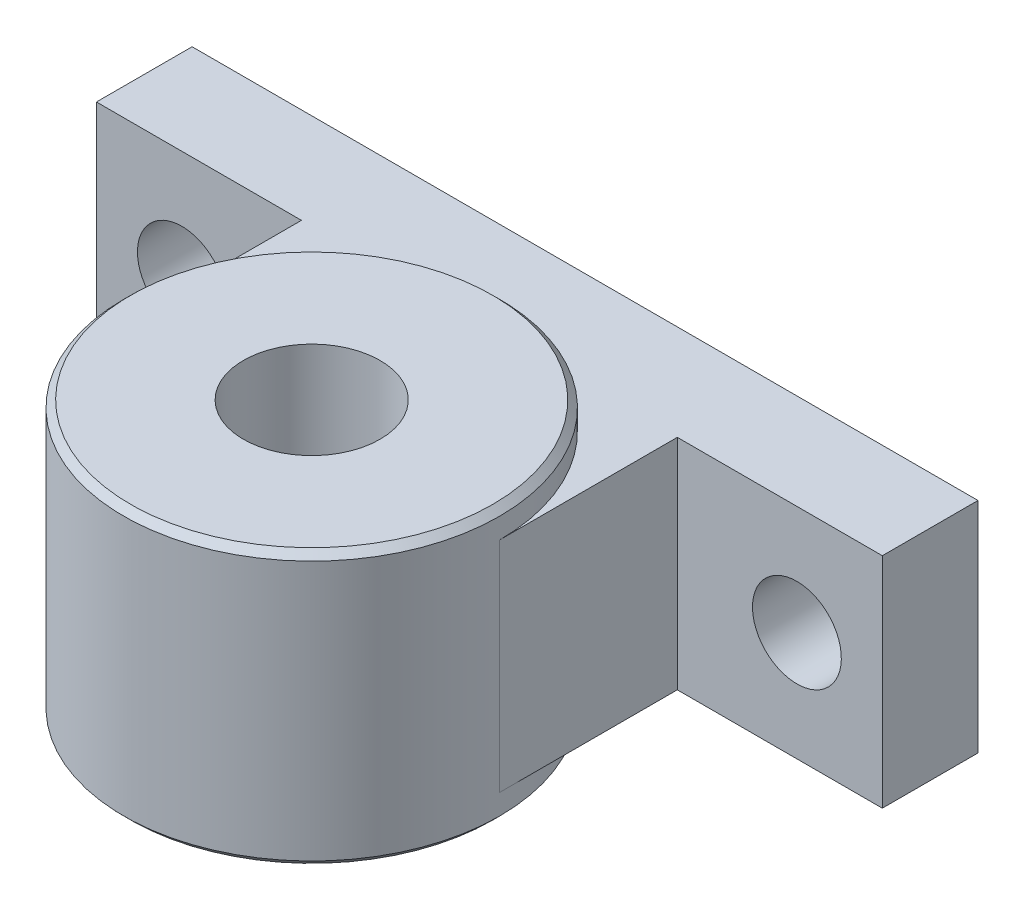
ISO-10303-21;
HEADER;
FILE_DESCRIPTION(('STEP AP214'),'2;1');
FILE_NAME('part.step','',(''),(''),'','','');
FILE_SCHEMA(('AUTOMOTIVE_DESIGN { 1 0 10303 214 1 1 1 1 }'));
ENDSEC;
DATA;
#1=APPLICATION_CONTEXT('core data for automotive mechanical design processes');
#2=APPLICATION_PROTOCOL_DEFINITION('international standard','automotive_design',2000,#1);
#3=PRODUCT_CONTEXT('',#1,'mechanical');
#4=PRODUCT('Part','Part','',(#3));
#5=PRODUCT_RELATED_PRODUCT_CATEGORY('part','',(#4));
#6=PRODUCT_DEFINITION_FORMATION('','',#4);
#7=PRODUCT_DEFINITION_CONTEXT('part definition',#1,'design');
#8=PRODUCT_DEFINITION('design','',#6,#7);
#9=PRODUCT_DEFINITION_SHAPE('','',#8);
#10=(LENGTH_UNIT() NAMED_UNIT(*) SI_UNIT(.MILLI.,.METRE.));
#11=(NAMED_UNIT(*) PLANE_ANGLE_UNIT() SI_UNIT($,.RADIAN.));
#12=(NAMED_UNIT(*) SI_UNIT($,.STERADIAN.) SOLID_ANGLE_UNIT());
#13=UNCERTAINTY_MEASURE_WITH_UNIT(LENGTH_MEASURE(1.E-05),#10,'distance_accuracy_value','');
#14=(GEOMETRIC_REPRESENTATION_CONTEXT(3) GLOBAL_UNCERTAINTY_ASSIGNED_CONTEXT((#13)) GLOBAL_UNIT_ASSIGNED_CONTEXT((#10,
#11,#12)) REPRESENTATION_CONTEXT('',''));
#15=CARTESIAN_POINT('',(0.,0.,0.));
#16=DIRECTION('',(0.,0.,1.));
#17=DIRECTION('',(1.,0.,0.));
#18=AXIS2_PLACEMENT_3D('',#15,#16,#17);
#19=CARTESIAN_POINT('',(-12.5,16.,14.));
#20=DIRECTION('',(0.,0.,1.));
#21=DIRECTION('',(0.,-1.,0.));
#22=AXIS2_PLACEMENT_3D('',#19,#20,#21);
#23=PLANE('',#22);
#24=CARTESIAN_POINT('',(0.,0.,14.));
#25=DIRECTION('',(0.,0.,1.));
#26=DIRECTION('',(0.,-1.,0.));
#27=AXIS2_PLACEMENT_3D('',#24,#25,#26);
#28=CIRCLE('',#27,6.5);
#29=CARTESIAN_POINT('',(0.,-6.5,14.));
#30=VERTEX_POINT('',#29);
#31=EDGE_CURVE('E154',#30,#30,#28,.T.);
#32=ORIENTED_EDGE('',*,*,#31,.F.);
#33=EDGE_LOOP('',(#32));
#34=FACE_BOUND('',#33,.T.);
#35=DIRECTION('',(-1.,0.,0.));
#36=VECTOR('',#35,1.);
#37=CARTESIAN_POINT('',(102.5,-16.,14.));
#38=LINE('',#37,#36);
#39=CARTESIAN_POINT('',(17.5,-16.,14.));
#40=VERTEX_POINT('',#39);
#41=CARTESIAN_POINT('',(-12.5,-16.,14.));
#42=VERTEX_POINT('',#41);
#43=EDGE_CURVE('E172',#40,#42,#38,.T.);
#44=ORIENTED_EDGE('',*,*,#43,.F.);
#45=DIRECTION('',(0.,1.,0.));
#46=VECTOR('',#45,1.);
#47=CARTESIAN_POINT('',(17.5,-16.,14.));
#48=LINE('',#47,#46);
#49=CARTESIAN_POINT('',(17.5,16.,14.));
#50=VERTEX_POINT('',#49);
#51=EDGE_CURVE('E97',#40,#50,#48,.T.);
#52=ORIENTED_EDGE('',*,*,#51,.T.);
#53=DIRECTION('',(1.,0.,0.));
#54=VECTOR('',#53,1.);
#55=CARTESIAN_POINT('',(-12.5,16.,14.));
#56=LINE('',#55,#54);
#57=CARTESIAN_POINT('',(-12.5,16.,14.));
#58=VERTEX_POINT('',#57);
#59=EDGE_CURVE('E179',#58,#50,#56,.T.);
#60=ORIENTED_EDGE('',*,*,#59,.F.);
#61=DIRECTION('',(0.,-1.,0.));
#62=VECTOR('',#61,1.);
#63=CARTESIAN_POINT('',(-12.5,16.,14.));
#64=LINE('',#63,#62);
#65=EDGE_CURVE('E169',#58,#42,#64,.T.);
#66=ORIENTED_EDGE('',*,*,#65,.T.);
#67=EDGE_LOOP('',(#44,#52,#60,#66));
#68=FACE_BOUND('',#67,.T.);
#69=ADVANCED_FACE('F14',(#34,#68),#23,.T.);
#70=DIRECTION('',(0.,1.,0.));
#71=VECTOR('',#70,1.);
#72=CARTESIAN_POINT('',(72.5,-16.,14.));
#73=LINE('',#72,#71);
#74=CARTESIAN_POINT('',(72.5,-16.,14.));
#75=VERTEX_POINT('',#74);
#76=CARTESIAN_POINT('',(72.5,16.,14.));
#77=VERTEX_POINT('',#76);
#78=EDGE_CURVE('E108',#75,#77,#73,.T.);
#79=ORIENTED_EDGE('',*,*,#78,.F.);
#80=CARTESIAN_POINT('',(102.5,-16.,14.));
#81=VERTEX_POINT('',#80);
#82=EDGE_CURVE('E173',#81,#75,#38,.T.);
#83=ORIENTED_EDGE('',*,*,#82,.F.);
#84=DIRECTION('',(0.,1.,0.));
#85=VECTOR('',#84,1.);
#86=CARTESIAN_POINT('',(102.5,-16.,14.));
#87=LINE('',#86,#85);
#88=CARTESIAN_POINT('',(102.5,16.,14.));
#89=VERTEX_POINT('',#88);
#90=EDGE_CURVE('E175',#81,#89,#87,.T.);
#91=ORIENTED_EDGE('',*,*,#90,.T.);
#92=EDGE_CURVE('E178',#77,#89,#56,.T.);
#93=ORIENTED_EDGE('',*,*,#92,.F.);
#94=EDGE_LOOP('',(#79,#83,#91,#93));
#95=FACE_BOUND('',#94,.T.);
#96=CARTESIAN_POINT('',(90.,0.,14.));
#97=DIRECTION('',(0.,0.,-1.));
#98=DIRECTION('',(0.,1.,0.));
#99=AXIS2_PLACEMENT_3D('',#96,#97,#98);
#100=CIRCLE('',#99,6.5);
#101=CARTESIAN_POINT('',(90.,6.5,14.));
#102=VERTEX_POINT('',#101);
#103=EDGE_CURVE('E148',#102,#102,#100,.T.);
#104=ORIENTED_EDGE('',*,*,#103,.T.);
#105=EDGE_LOOP('',(#104));
#106=FACE_BOUND('',#105,.T.);
#107=ADVANCED_FACE('F201',(#95,#106),#23,.T.);
#108=CARTESIAN_POINT('',(-12.5,16.,0.));
#109=DIRECTION('',(0.,0.,1.));
#110=DIRECTION('',(0.,-1.,0.));
#111=AXIS2_PLACEMENT_3D('',#108,#109,#110);
#112=PLANE('',#111);
#113=CARTESIAN_POINT('',(90.,0.,0.));
#114=DIRECTION('',(0.,0.,-1.));
#115=DIRECTION('',(0.,1.,0.));
#116=AXIS2_PLACEMENT_3D('',#113,#114,#115);
#117=CIRCLE('',#116,6.5);
#118=CARTESIAN_POINT('',(90.,6.5,0.));
#119=VERTEX_POINT('',#118);
#120=EDGE_CURVE('E107',#119,#119,#117,.T.);
#121=ORIENTED_EDGE('',*,*,#120,.F.);
#122=EDGE_LOOP('',(#121));
#123=FACE_BOUND('',#122,.T.);
#124=DIRECTION('',(0.,-1.,0.));
#125=VECTOR('',#124,1.);
#126=CARTESIAN_POINT('',(-12.5,16.,0.));
#127=LINE('',#126,#125);
#128=CARTESIAN_POINT('',(-12.5,16.,0.));
#129=VERTEX_POINT('',#128);
#130=CARTESIAN_POINT('',(-12.5,-16.,0.));
#131=VERTEX_POINT('',#130);
#132=EDGE_CURVE('E157',#129,#131,#127,.T.);
#133=ORIENTED_EDGE('',*,*,#132,.F.);
#134=DIRECTION('',(1.,0.,0.));
#135=VECTOR('',#134,1.);
#136=CARTESIAN_POINT('',(-12.5,16.,0.));
#137=LINE('',#136,#135);
#138=CARTESIAN_POINT('',(102.5,16.,0.));
#139=VERTEX_POINT('',#138);
#140=EDGE_CURVE('E166',#129,#139,#137,.T.);
#141=ORIENTED_EDGE('',*,*,#140,.T.);
#142=DIRECTION('',(0.,1.,0.));
#143=VECTOR('',#142,1.);
#144=CARTESIAN_POINT('',(102.5,-16.,0.));
#145=LINE('',#144,#143);
#146=CARTESIAN_POINT('',(102.5,-16.,0.));
#147=VERTEX_POINT('',#146);
#148=EDGE_CURVE('E163',#147,#139,#145,.T.);
#149=ORIENTED_EDGE('',*,*,#148,.F.);
#150=DIRECTION('',(-1.,0.,0.));
#151=VECTOR('',#150,1.);
#152=CARTESIAN_POINT('',(102.5,-16.,0.));
#153=LINE('',#152,#151);
#154=EDGE_CURVE('E160',#147,#131,#153,.T.);
#155=ORIENTED_EDGE('',*,*,#154,.T.);
#156=EDGE_LOOP('',(#133,#141,#149,#155));
#157=FACE_BOUND('',#156,.T.);
#158=CARTESIAN_POINT('',(0.,0.,0.));
#159=DIRECTION('',(0.,0.,1.));
#160=DIRECTION('',(0.,-1.,0.));
#161=AXIS2_PLACEMENT_3D('',#158,#159,#160);
#162=CIRCLE('',#161,6.5);
#163=CARTESIAN_POINT('',(0.,-6.5,0.));
#164=VERTEX_POINT('',#163);
#165=EDGE_CURVE('E151',#164,#164,#162,.T.);
#166=ORIENTED_EDGE('',*,*,#165,.T.);
#167=EDGE_LOOP('',(#166));
#168=FACE_BOUND('',#167,.T.);
#169=ADVANCED_FACE('F192',(#123,#157,#168),#112,.F.);
#170=CARTESIAN_POINT('',(-12.5,16.,14.));
#171=DIRECTION('',(1.,0.,0.));
#172=DIRECTION('',(0.,1.,0.));
#173=AXIS2_PLACEMENT_3D('',#170,#171,#172);
#174=PLANE('',#173);
#175=DIRECTION('',(0.,0.,-1.));
#176=VECTOR('',#175,1.);
#177=CARTESIAN_POINT('',(-12.5,-16.,14.));
#178=LINE('',#177,#176);
#179=EDGE_CURVE('E114',#42,#131,#178,.T.);
#180=ORIENTED_EDGE('',*,*,#179,.F.);
#181=ORIENTED_EDGE('',*,*,#65,.F.);
#182=DIRECTION('',(0.,0.,-1.));
#183=VECTOR('',#182,1.);
#184=CARTESIAN_POINT('',(-12.5,16.,14.));
#185=LINE('',#184,#183);
#186=EDGE_CURVE('E37',#58,#129,#185,.T.);
#187=ORIENTED_EDGE('',*,*,#186,.T.);
#188=ORIENTED_EDGE('',*,*,#132,.T.);
#189=EDGE_LOOP('',(#180,#181,#187,#188));
#190=FACE_BOUND('',#189,.T.);
#191=ADVANCED_FACE('F190',(#190),#174,.F.);
#192=CARTESIAN_POINT('',(102.5,-16.,14.));
#193=DIRECTION('',(0.,-1.,0.));
#194=DIRECTION('',(1.,0.,0.));
#195=AXIS2_PLACEMENT_3D('',#192,#193,#194);
#196=PLANE('',#195);
#197=CARTESIAN_POINT('',(45.,-16.,40.));
#198=DIRECTION('',(0.,-1.,0.));
#199=DIRECTION('',(1.,0.,0.));
#200=AXIS2_PLACEMENT_3D('',#197,#198,#199);
#201=CIRCLE('',#200,27.5);
#202=CARTESIAN_POINT('',(17.5,-16.,40.));
#203=VERTEX_POINT('',#202);
#204=CARTESIAN_POINT('',(72.5,-16.,40.));
#205=VERTEX_POINT('',#204);
#206=EDGE_CURVE('E82',#203,#205,#201,.T.);
#207=ORIENTED_EDGE('',*,*,#206,.F.);
#208=DIRECTION('',(0.,0.,-1.));
#209=VECTOR('',#208,1.);
#210=CARTESIAN_POINT('',(17.5,-16.,40.));
#211=LINE('',#210,#209);
#212=EDGE_CURVE('E91',#203,#40,#211,.T.);
#213=ORIENTED_EDGE('',*,*,#212,.T.);
#214=ORIENTED_EDGE('',*,*,#43,.T.);
#215=ORIENTED_EDGE('',*,*,#179,.T.);
#216=ORIENTED_EDGE('',*,*,#154,.F.);
#217=DIRECTION('',(0.,0.,-1.));
#218=VECTOR('',#217,1.);
#219=CARTESIAN_POINT('',(102.5,-16.,14.));
#220=LINE('',#219,#218);
#221=EDGE_CURVE('E184',#81,#147,#220,.T.);
#222=ORIENTED_EDGE('',*,*,#221,.F.);
#223=ORIENTED_EDGE('',*,*,#82,.T.);
#224=DIRECTION('',(0.,0.,-1.));
#225=VECTOR('',#224,1.);
#226=CARTESIAN_POINT('',(72.5,-16.,40.));
#227=LINE('',#226,#225);
#228=EDGE_CURVE('E94',#205,#75,#227,.T.);
#229=ORIENTED_EDGE('',*,*,#228,.F.);
#230=EDGE_LOOP('',(#207,#213,#214,#215,#216,#222,#223,#229));
#231=FACE_BOUND('',#230,.T.);
#232=ADVANCED_FACE('F16',(#231),#196,.T.);
#233=CARTESIAN_POINT('',(102.5,-16.,14.));
#234=DIRECTION('',(-1.,0.,0.));
#235=DIRECTION('',(0.,-1.,0.));
#236=AXIS2_PLACEMENT_3D('',#233,#234,#235);
#237=PLANE('',#236);
#238=DIRECTION('',(0.,0.,-1.));
#239=VECTOR('',#238,1.);
#240=CARTESIAN_POINT('',(102.5,16.,14.));
#241=LINE('',#240,#239);
#242=EDGE_CURVE('E182',#89,#139,#241,.T.);
#243=ORIENTED_EDGE('',*,*,#242,.F.);
#244=ORIENTED_EDGE('',*,*,#90,.F.);
#245=ORIENTED_EDGE('',*,*,#221,.T.);
#246=ORIENTED_EDGE('',*,*,#148,.T.);
#247=EDGE_LOOP('',(#243,#244,#245,#246));
#248=FACE_BOUND('',#247,.T.);
#249=ADVANCED_FACE('F196',(#248),#237,.F.);
#250=CARTESIAN_POINT('',(-12.5,16.,14.));
#251=DIRECTION('',(0.,1.,0.));
#252=DIRECTION('',(-1.,0.,0.));
#253=AXIS2_PLACEMENT_3D('',#250,#251,#252);
#254=PLANE('',#253);
#255=CARTESIAN_POINT('',(45.,16.,40.));
#256=DIRECTION('',(0.,1.,0.));
#257=DIRECTION('',(-1.,0.,0.));
#258=AXIS2_PLACEMENT_3D('',#255,#256,#257);
#259=CIRCLE('',#258,27.5);
#260=CARTESIAN_POINT('',(72.5,16.,40.));
#261=VERTEX_POINT('',#260);
#262=CARTESIAN_POINT('',(17.5,16.,40.));
#263=VERTEX_POINT('',#262);
#264=EDGE_CURVE('E85',#261,#263,#259,.T.);
#265=ORIENTED_EDGE('',*,*,#264,.F.);
#266=DIRECTION('',(0.,0.,-1.));
#267=VECTOR('',#266,1.);
#268=CARTESIAN_POINT('',(72.5,16.,40.));
#269=LINE('',#268,#267);
#270=EDGE_CURVE('E100',#261,#77,#269,.T.);
#271=ORIENTED_EDGE('',*,*,#270,.T.);
#272=ORIENTED_EDGE('',*,*,#92,.T.);
#273=ORIENTED_EDGE('',*,*,#242,.T.);
#274=ORIENTED_EDGE('',*,*,#140,.F.);
#275=ORIENTED_EDGE('',*,*,#186,.F.);
#276=ORIENTED_EDGE('',*,*,#59,.T.);
#277=DIRECTION('',(0.,0.,-1.));
#278=VECTOR('',#277,1.);
#279=CARTESIAN_POINT('',(17.5,16.,40.));
#280=LINE('',#279,#278);
#281=EDGE_CURVE('E29',#263,#50,#280,.T.);
#282=ORIENTED_EDGE('',*,*,#281,.F.);
#283=EDGE_LOOP('',(#265,#271,#272,#273,#274,#275,#276,#282));
#284=FACE_BOUND('',#283,.T.);
#285=ADVANCED_FACE('F207',(#284),#254,.T.);
#286=CARTESIAN_POINT('',(0.,0.,14.));
#287=DIRECTION('',(0.,0.,-1.));
#288=DIRECTION('',(0.,1.,0.));
#289=AXIS2_PLACEMENT_3D('',#286,#287,#288);
#290=CYLINDRICAL_SURFACE('',#289,6.5);
#291=ORIENTED_EDGE('',*,*,#31,.T.);
#292=EDGE_LOOP('',(#291));
#293=FACE_BOUND('',#292,.T.);
#294=ORIENTED_EDGE('',*,*,#165,.F.);
#295=EDGE_LOOP('',(#294));
#296=FACE_BOUND('',#295,.T.);
#297=ADVANCED_FACE('F224',(#293,#296),#290,.F.);
#298=CARTESIAN_POINT('',(90.,0.,14.));
#299=DIRECTION('',(0.,0.,-1.));
#300=DIRECTION('',(0.,1.,0.));
#301=AXIS2_PLACEMENT_3D('',#298,#299,#300);
#302=CYLINDRICAL_SURFACE('',#301,6.5);
#303=ORIENTED_EDGE('',*,*,#103,.F.);
#304=EDGE_LOOP('',(#303));
#305=FACE_BOUND('',#304,.T.);
#306=ORIENTED_EDGE('',*,*,#120,.T.);
#307=EDGE_LOOP('',(#306));
#308=FACE_BOUND('',#307,.T.);
#309=ADVANCED_FACE('F281',(#305,#308),#302,.F.);
#310=CARTESIAN_POINT('',(72.5,16.,40.));
#311=DIRECTION('',(-1.,0.,0.));
#312=DIRECTION('',(0.,-1.,0.));
#313=AXIS2_PLACEMENT_3D('',#310,#311,#312);
#314=PLANE('',#313);
#315=DIRECTION('',(0.,1.,0.));
#316=VECTOR('',#315,1.);
#317=CARTESIAN_POINT('',(72.5,-16.,40.));
#318=LINE('',#317,#316);
#319=EDGE_CURVE('E98',#205,#261,#318,.T.);
#320=ORIENTED_EDGE('',*,*,#319,.F.);
#321=ORIENTED_EDGE('',*,*,#228,.T.);
#322=ORIENTED_EDGE('',*,*,#78,.T.);
#323=ORIENTED_EDGE('',*,*,#270,.F.);
#324=EDGE_LOOP('',(#320,#321,#322,#323));
#325=FACE_BOUND('',#324,.T.);
#326=ADVANCED_FACE('F206',(#325),#314,.F.);
#327=CARTESIAN_POINT('',(17.5,16.,40.));
#328=DIRECTION('',(-1.,0.,0.));
#329=DIRECTION('',(0.,-1.,0.));
#330=AXIS2_PLACEMENT_3D('',#327,#328,#329);
#331=PLANE('',#330);
#332=DIRECTION('',(0.,1.,0.));
#333=VECTOR('',#332,1.);
#334=CARTESIAN_POINT('',(17.5,-16.,40.));
#335=LINE('',#334,#333);
#336=EDGE_CURVE('E79',#203,#263,#335,.T.);
#337=ORIENTED_EDGE('',*,*,#336,.T.);
#338=ORIENTED_EDGE('',*,*,#281,.T.);
#339=ORIENTED_EDGE('',*,*,#51,.F.);
#340=ORIENTED_EDGE('',*,*,#212,.F.);
#341=EDGE_LOOP('',(#337,#338,#339,#340));
#342=FACE_BOUND('',#341,.T.);
#343=ADVANCED_FACE('F96',(#342),#331,.T.);
#344=CARTESIAN_POINT('',(45.,20.,40.));
#345=DIRECTION('',(0.,-1.,0.));
#346=DIRECTION('',(1.,0.,0.));
#347=AXIS2_PLACEMENT_3D('',#344,#345,#346);
#348=CYLINDRICAL_SURFACE('',#347,27.5);
#349=CARTESIAN_POINT('',(45.,-19.,40.));
#350=DIRECTION('',(0.,-1.,0.));
#351=DIRECTION('',(1.,0.,0.));
#352=AXIS2_PLACEMENT_3D('',#349,#350,#351);
#353=CIRCLE('',#352,27.5);
#354=CARTESIAN_POINT('',(72.5,-19.,40.));
#355=VERTEX_POINT('',#354);
#356=EDGE_CURVE('E22',#355,#355,#353,.F.);
#357=ORIENTED_EDGE('',*,*,#356,.T.);
#358=EDGE_LOOP('',(#357));
#359=FACE_BOUND('',#358,.T.);
#360=CARTESIAN_POINT('',(45.,19.,40.));
#361=DIRECTION('',(0.,-1.,0.));
#362=DIRECTION('',(1.,0.,0.));
#363=AXIS2_PLACEMENT_3D('',#360,#361,#362);
#364=CIRCLE('',#363,27.5);
#365=CARTESIAN_POINT('',(72.5,19.,40.));
#366=VERTEX_POINT('',#365);
#367=EDGE_CURVE('E113',#366,#366,#364,.T.);
#368=ORIENTED_EDGE('',*,*,#367,.T.);
#369=EDGE_LOOP('',(#368));
#370=FACE_BOUND('',#369,.T.);
#371=ORIENTED_EDGE('',*,*,#319,.T.);
#372=ORIENTED_EDGE('',*,*,#264,.T.);
#373=ORIENTED_EDGE('',*,*,#336,.F.);
#374=ORIENTED_EDGE('',*,*,#206,.T.);
#375=EDGE_LOOP('',(#371,#372,#373,#374));
#376=FACE_BOUND('',#375,.T.);
#377=ADVANCED_FACE('F81',(#359,#370,#376),#348,.T.);
#378=CARTESIAN_POINT('',(45.,20.,40.));
#379=DIRECTION('',(0.,-1.,0.));
#380=DIRECTION('',(1.,0.,0.));
#381=AXIS2_PLACEMENT_3D('',#378,#379,#380);
#382=PLANE('',#381);
#383=CARTESIAN_POINT('',(45.,20.,40.));
#384=DIRECTION('',(0.,-1.,0.));
#385=DIRECTION('',(1.,0.,0.));
#386=AXIS2_PLACEMENT_3D('',#383,#384,#385);
#387=CIRCLE('',#386,26.5);
#388=CARTESIAN_POINT('',(71.5,20.,40.));
#389=VERTEX_POINT('',#388);
#390=EDGE_CURVE('E9',#389,#389,#387,.F.);
#391=ORIENTED_EDGE('',*,*,#390,.T.);
#392=EDGE_LOOP('',(#391));
#393=FACE_BOUND('',#392,.T.);
#394=CARTESIAN_POINT('',(45.,20.,40.));
#395=DIRECTION('',(0.,-1.,0.));
#396=DIRECTION('',(1.,0.,0.));
#397=AXIS2_PLACEMENT_3D('',#394,#395,#396);
#398=CIRCLE('',#397,10.);
#399=CARTESIAN_POINT('',(55.,20.,40.));
#400=VERTEX_POINT('',#399);
#401=EDGE_CURVE('E138',#400,#400,#398,.T.);
#402=ORIENTED_EDGE('',*,*,#401,.T.);
#403=EDGE_LOOP('',(#402));
#404=FACE_BOUND('',#403,.T.);
#405=ADVANCED_FACE('F132',(#393,#404),#382,.F.);
#406=CARTESIAN_POINT('',(45.,-20.,40.));
#407=DIRECTION('',(0.,-1.,0.));
#408=DIRECTION('',(1.,0.,0.));
#409=AXIS2_PLACEMENT_3D('',#406,#407,#408);
#410=PLANE('',#409);
#411=CARTESIAN_POINT('',(45.,-20.,40.));
#412=DIRECTION('',(0.,-1.,0.));
#413=DIRECTION('',(1.,0.,0.));
#414=AXIS2_PLACEMENT_3D('',#411,#412,#413);
#415=CIRCLE('',#414,26.5);
#416=CARTESIAN_POINT('',(71.5,-20.,40.));
#417=VERTEX_POINT('',#416);
#418=EDGE_CURVE('E110',#417,#417,#415,.T.);
#419=ORIENTED_EDGE('',*,*,#418,.T.);
#420=EDGE_LOOP('',(#419));
#421=FACE_BOUND('',#420,.T.);
#422=CARTESIAN_POINT('',(45.,-20.,40.));
#423=DIRECTION('',(0.,-1.,0.));
#424=DIRECTION('',(1.,0.,0.));
#425=AXIS2_PLACEMENT_3D('',#422,#423,#424);
#426=CIRCLE('',#425,10.);
#427=CARTESIAN_POINT('',(55.,-20.,40.));
#428=VERTEX_POINT('',#427);
#429=EDGE_CURVE('E136',#428,#428,#426,.T.);
#430=ORIENTED_EDGE('',*,*,#429,.F.);
#431=EDGE_LOOP('',(#430));
#432=FACE_BOUND('',#431,.T.);
#433=ADVANCED_FACE('F129',(#421,#432),#410,.T.);
#434=CARTESIAN_POINT('',(45.,20.,40.));
#435=DIRECTION('',(0.,-1.,0.));
#436=DIRECTION('',(1.,0.,0.));
#437=AXIS2_PLACEMENT_3D('',#434,#435,#436);
#438=CYLINDRICAL_SURFACE('',#437,10.);
#439=ORIENTED_EDGE('',*,*,#401,.F.);
#440=EDGE_LOOP('',(#439));
#441=FACE_BOUND('',#440,.T.);
#442=ORIENTED_EDGE('',*,*,#429,.T.);
#443=EDGE_LOOP('',(#442));
#444=FACE_BOUND('',#443,.T.);
#445=ADVANCED_FACE('F125',(#441,#444),#438,.F.);
#446=CARTESIAN_POINT('',(45.,-20.,40.));
#447=DIRECTION('',(0.,1.,0.));
#448=DIRECTION('',(-1.,0.,0.));
#449=AXIS2_PLACEMENT_3D('',#446,#447,#448);
#450=CONICAL_SURFACE('',#449,26.5,0.785398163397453);
#451=ORIENTED_EDGE('',*,*,#356,.F.);
#452=EDGE_LOOP('',(#451));
#453=FACE_BOUND('',#452,.T.);
#454=ORIENTED_EDGE('',*,*,#418,.F.);
#455=EDGE_LOOP('',(#454));
#456=FACE_BOUND('',#455,.T.);
#457=ADVANCED_FACE('F121',(#453,#456),#450,.T.);
#458=CARTESIAN_POINT('',(45.,19.,40.));
#459=DIRECTION('',(0.,-1.,0.));
#460=DIRECTION('',(1.,0.,0.));
#461=AXIS2_PLACEMENT_3D('',#458,#459,#460);
#462=CONICAL_SURFACE('',#461,27.5,0.785398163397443);
#463=ORIENTED_EDGE('',*,*,#390,.F.);
#464=EDGE_LOOP('',(#463));
#465=FACE_BOUND('',#464,.T.);
#466=ORIENTED_EDGE('',*,*,#367,.F.);
#467=EDGE_LOOP('',(#466));
#468=FACE_BOUND('',#467,.T.);
#469=ADVANCED_FACE('F124',(#465,#468),#462,.T.);
#470=CLOSED_SHELL('',(#69,#107,#169,#191,#232,#249,#285,#297,#309,#326,#343,#377,#405,#433,#445,
#457,#469));
#471=MANIFOLD_SOLID_BREP('B1',#470);
#472=ADVANCED_BREP_SHAPE_REPRESENTATION('',(#18,#471),#14);
#473=SHAPE_DEFINITION_REPRESENTATION(#9,#472);
ENDSEC;
END-ISO-10303-21;
